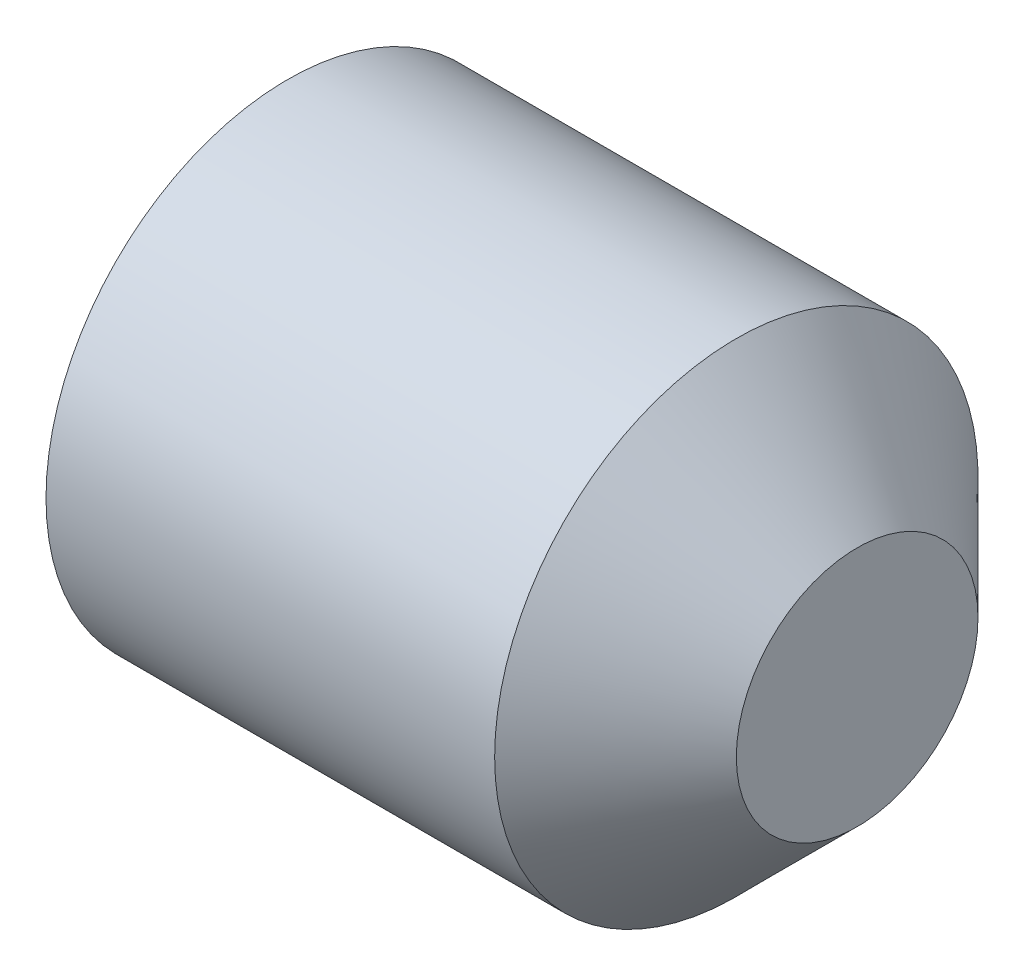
from build123d import *

# Parameters (mm, degrees)
HEXAGONSOCKET_DEPTH = 0.7


with BuildPart() as part:
    # BodySke → BaseBody (revolve)
    with BuildSketch(Plane.XY, mode=Mode.PRIVATE) as basebody_sk:
        Polygon((2, 0), (2, 0.4), (1.6, 0.8), (0, 0.8), (0, 0), align=None)
    revolve(basebody_sk.sketch.rotate(Axis((0, 0, 0), (1, 0, 0)), 90), axis=Axis((0, 0, 0), (1, 0, 0)))

    # HeadChamferSke → HeadChamfer (revolve, cut)
    with BuildSketch(Plane.XY, mode=Mode.PRIVATE) as headchamfer_sk:
        Polygon((0, 0.8), (0, 0.601), (0.114892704, 0.8), align=None)
    revolve(headchamfer_sk.sketch.rotate(Axis((0, 0, 0), (1, 0, 0)), 90), axis=Axis((0, 0, 0), (1, 0, 0)), mode=Mode.SUBTRACT)

    # HexagonSocketSke → HexagonSocket (cut)
    with BuildSketch(Plane.ZY):
        Polygon((0, 0.404145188), (-0.35, 0.202072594), (-0.35, -0.202072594), (0, -0.404145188), (0.35, -0.202072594), (0.35, 0.202072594), align=None)
    extrude(amount=-HEXAGONSOCKET_DEPTH, mode=Mode.SUBTRACT)


solid = part.part
